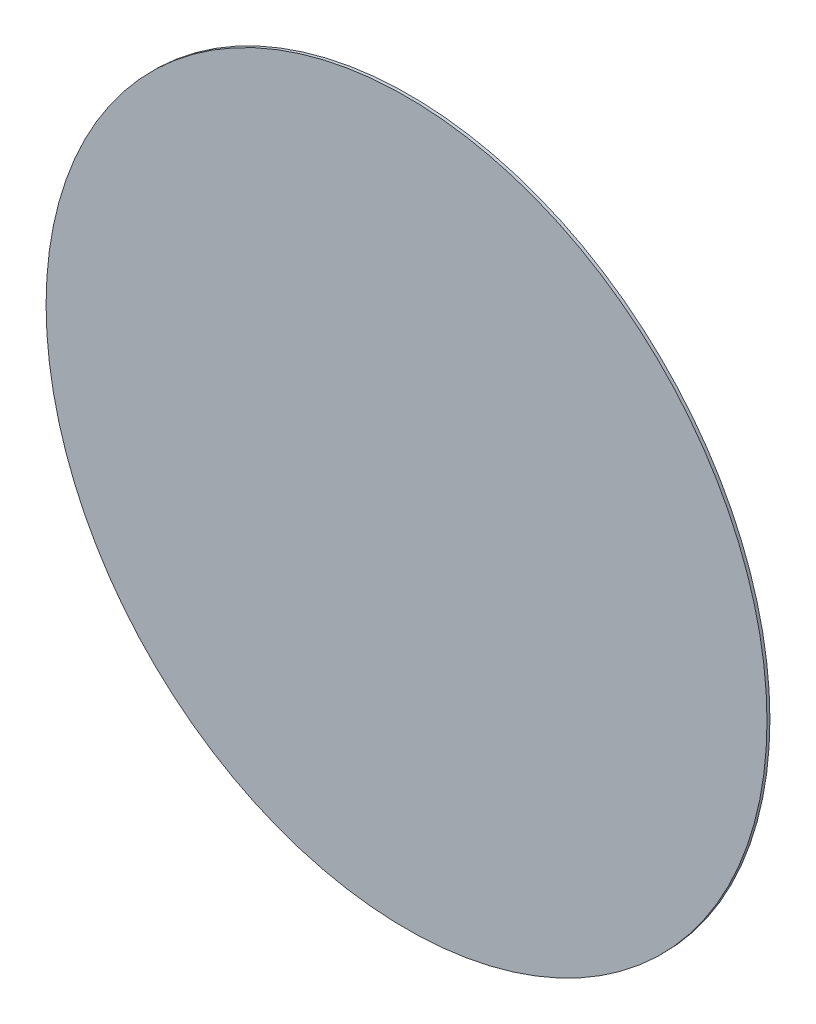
from build123d import *

# Parameters (mm, degrees)
SKETCH1_R      = 12.5
EXTRUDE1_DEPTH = 0.1016


with BuildPart() as part:
    # Sketch1 → Extrude1 (new body)
    with BuildSketch(Plane.XY):
        Circle(SKETCH1_R)
    extrude(amount=EXTRUDE1_DEPTH)


solid = part.part
